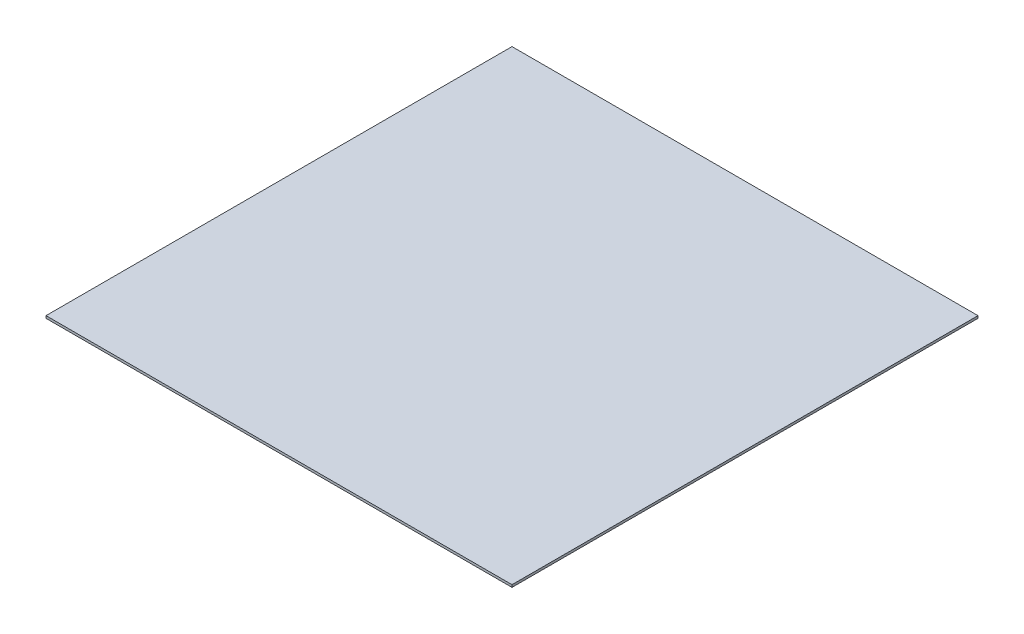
ISO-10303-21;
HEADER;
FILE_DESCRIPTION(('STEP AP214'),'2;1');
FILE_NAME('part.step','',(''),(''),'','','');
FILE_SCHEMA(('AUTOMOTIVE_DESIGN { 1 0 10303 214 1 1 1 1 }'));
ENDSEC;
DATA;
#1=APPLICATION_CONTEXT('core data for automotive mechanical design processes');
#2=APPLICATION_PROTOCOL_DEFINITION('international standard','automotive_design',2000,#1);
#3=PRODUCT_CONTEXT('',#1,'mechanical');
#4=PRODUCT('Part','Part','',(#3));
#5=PRODUCT_RELATED_PRODUCT_CATEGORY('part','',(#4));
#6=PRODUCT_DEFINITION_FORMATION('','',#4);
#7=PRODUCT_DEFINITION_CONTEXT('part definition',#1,'design');
#8=PRODUCT_DEFINITION('design','',#6,#7);
#9=PRODUCT_DEFINITION_SHAPE('','',#8);
#10=(LENGTH_UNIT() NAMED_UNIT(*) SI_UNIT(.MILLI.,.METRE.));
#11=(NAMED_UNIT(*) PLANE_ANGLE_UNIT() SI_UNIT($,.RADIAN.));
#12=(NAMED_UNIT(*) SI_UNIT($,.STERADIAN.) SOLID_ANGLE_UNIT());
#13=UNCERTAINTY_MEASURE_WITH_UNIT(LENGTH_MEASURE(1.E-05),#10,'distance_accuracy_value','');
#14=(GEOMETRIC_REPRESENTATION_CONTEXT(3) GLOBAL_UNCERTAINTY_ASSIGNED_CONTEXT((#13)) GLOBAL_UNIT_ASSIGNED_CONTEXT((#10,
#11,#12)) REPRESENTATION_CONTEXT('',''));
#15=CARTESIAN_POINT('',(0.,0.,0.));
#16=DIRECTION('',(0.,0.,1.));
#17=DIRECTION('',(1.,0.,0.));
#18=AXIS2_PLACEMENT_3D('',#15,#16,#17);
#19=CARTESIAN_POINT('',(2500.,12.7,-2500.));
#20=DIRECTION('',(0.,0.,1.));
#21=DIRECTION('',(1.,0.,0.));
#22=AXIS2_PLACEMENT_3D('',#19,#20,#21);
#23=PLANE('',#22);
#24=DIRECTION('',(0.,1.,0.));
#25=VECTOR('',#24,1.);
#26=CARTESIAN_POINT('',(-2500.,12.7,-2500.));
#27=LINE('',#26,#25);
#28=CARTESIAN_POINT('',(-2500.,-12.7,-2500.));
#29=VERTEX_POINT('',#28);
#30=CARTESIAN_POINT('',(-2500.,12.7,-2500.));
#31=VERTEX_POINT('',#30);
#32=EDGE_CURVE('E95',#29,#31,#27,.T.);
#33=ORIENTED_EDGE('',*,*,#32,.T.);
#34=DIRECTION('',(-1.,0.,0.));
#35=VECTOR('',#34,1.);
#36=CARTESIAN_POINT('',(2500.,12.7,-2500.));
#37=LINE('',#36,#35);
#38=CARTESIAN_POINT('',(2500.,12.7,-2500.));
#39=VERTEX_POINT('',#38);
#40=EDGE_CURVE('E11',#39,#31,#37,.T.);
#41=ORIENTED_EDGE('',*,*,#40,.F.);
#42=DIRECTION('',(0.,1.,0.));
#43=VECTOR('',#42,1.);
#44=CARTESIAN_POINT('',(2500.,12.7,-2500.));
#45=LINE('',#44,#43);
#46=CARTESIAN_POINT('',(2500.,-12.7,-2500.));
#47=VERTEX_POINT('',#46);
#48=EDGE_CURVE('E83',#47,#39,#45,.T.);
#49=ORIENTED_EDGE('',*,*,#48,.F.);
#50=DIRECTION('',(-1.,0.,0.));
#51=VECTOR('',#50,1.);
#52=CARTESIAN_POINT('',(2500.,-12.7,-2500.));
#53=LINE('',#52,#51);
#54=EDGE_CURVE('E91',#47,#29,#53,.T.);
#55=ORIENTED_EDGE('',*,*,#54,.T.);
#56=EDGE_LOOP('',(#33,#41,#49,#55));
#57=FACE_BOUND('',#56,.T.);
#58=ADVANCED_FACE('F32',(#57),#23,.F.);
#59=CARTESIAN_POINT('',(2500.,12.7,2500.));
#60=DIRECTION('',(0.,-1.,0.));
#61=DIRECTION('',(0.,0.,-1.));
#62=AXIS2_PLACEMENT_3D('',#59,#60,#61);
#63=PLANE('',#62);
#64=DIRECTION('',(0.,0.,1.));
#65=VECTOR('',#64,1.);
#66=CARTESIAN_POINT('',(-2500.,12.7,2500.));
#67=LINE('',#66,#65);
#68=CARTESIAN_POINT('',(-2500.,12.7,2500.));
#69=VERTEX_POINT('',#68);
#70=EDGE_CURVE('E87',#31,#69,#67,.T.);
#71=ORIENTED_EDGE('',*,*,#70,.T.);
#72=DIRECTION('',(-1.,0.,0.));
#73=VECTOR('',#72,1.);
#74=CARTESIAN_POINT('',(2500.,12.7,2500.));
#75=LINE('',#74,#73);
#76=CARTESIAN_POINT('',(2500.,12.7,2500.));
#77=VERTEX_POINT('',#76);
#78=EDGE_CURVE('E40',#77,#69,#75,.T.);
#79=ORIENTED_EDGE('',*,*,#78,.F.);
#80=DIRECTION('',(0.,0.,1.));
#81=VECTOR('',#80,1.);
#82=CARTESIAN_POINT('',(2500.,12.7,2500.));
#83=LINE('',#82,#81);
#84=EDGE_CURVE('E78',#39,#77,#83,.T.);
#85=ORIENTED_EDGE('',*,*,#84,.F.);
#86=ORIENTED_EDGE('',*,*,#40,.T.);
#87=EDGE_LOOP('',(#71,#79,#85,#86));
#88=FACE_BOUND('',#87,.T.);
#89=ADVANCED_FACE('F86',(#88),#63,.F.);
#90=CARTESIAN_POINT('',(2500.,12.7,2500.));
#91=DIRECTION('',(0.,0.,-1.));
#92=DIRECTION('',(-1.,0.,0.));
#93=AXIS2_PLACEMENT_3D('',#90,#91,#92);
#94=PLANE('',#93);
#95=DIRECTION('',(0.,-1.,0.));
#96=VECTOR('',#95,1.);
#97=CARTESIAN_POINT('',(-2500.,12.7,2500.));
#98=LINE('',#97,#96);
#99=CARTESIAN_POINT('',(-2500.,-12.7,2500.));
#100=VERTEX_POINT('',#99);
#101=EDGE_CURVE('E65',#69,#100,#98,.T.);
#102=ORIENTED_EDGE('',*,*,#101,.T.);
#103=DIRECTION('',(-1.,0.,0.));
#104=VECTOR('',#103,1.);
#105=CARTESIAN_POINT('',(2500.,-12.7,2500.));
#106=LINE('',#105,#104);
#107=CARTESIAN_POINT('',(2500.,-12.7,2500.));
#108=VERTEX_POINT('',#107);
#109=EDGE_CURVE('E88',#108,#100,#106,.T.);
#110=ORIENTED_EDGE('',*,*,#109,.F.);
#111=DIRECTION('',(0.,-1.,0.));
#112=VECTOR('',#111,1.);
#113=CARTESIAN_POINT('',(2500.,12.7,2500.));
#114=LINE('',#113,#112);
#115=EDGE_CURVE('E81',#77,#108,#114,.T.);
#116=ORIENTED_EDGE('',*,*,#115,.F.);
#117=ORIENTED_EDGE('',*,*,#78,.T.);
#118=EDGE_LOOP('',(#102,#110,#116,#117));
#119=FACE_BOUND('',#118,.T.);
#120=ADVANCED_FACE('F89',(#119),#94,.F.);
#121=CARTESIAN_POINT('',(2500.,-12.7,2500.));
#122=DIRECTION('',(0.,1.,0.));
#123=DIRECTION('',(0.,0.,1.));
#124=AXIS2_PLACEMENT_3D('',#121,#122,#123);
#125=PLANE('',#124);
#126=DIRECTION('',(0.,0.,-1.));
#127=VECTOR('',#126,1.);
#128=CARTESIAN_POINT('',(-2500.,-12.7,2500.));
#129=LINE('',#128,#127);
#130=EDGE_CURVE('E71',#100,#29,#129,.T.);
#131=ORIENTED_EDGE('',*,*,#130,.T.);
#132=ORIENTED_EDGE('',*,*,#54,.F.);
#133=DIRECTION('',(0.,0.,-1.));
#134=VECTOR('',#133,1.);
#135=CARTESIAN_POINT('',(2500.,-12.7,2500.));
#136=LINE('',#135,#134);
#137=EDGE_CURVE('E48',#108,#47,#136,.T.);
#138=ORIENTED_EDGE('',*,*,#137,.F.);
#139=ORIENTED_EDGE('',*,*,#109,.T.);
#140=EDGE_LOOP('',(#131,#132,#138,#139));
#141=FACE_BOUND('',#140,.T.);
#142=ADVANCED_FACE('F102',(#141),#125,.F.);
#143=CARTESIAN_POINT('',(2500.,0.,0.));
#144=DIRECTION('',(1.,0.,0.));
#145=DIRECTION('',(0.,0.,-1.));
#146=AXIS2_PLACEMENT_3D('',#143,#144,#145);
#147=PLANE('',#146);
#148=ORIENTED_EDGE('',*,*,#48,.T.);
#149=ORIENTED_EDGE('',*,*,#84,.T.);
#150=ORIENTED_EDGE('',*,*,#115,.T.);
#151=ORIENTED_EDGE('',*,*,#137,.T.);
#152=EDGE_LOOP('',(#148,#149,#150,#151));
#153=FACE_BOUND('',#152,.T.);
#154=ADVANCED_FACE('F79',(#153),#147,.T.);
#155=CARTESIAN_POINT('',(-2500.,0.,0.));
#156=DIRECTION('',(1.,0.,0.));
#157=DIRECTION('',(0.,0.,-1.));
#158=AXIS2_PLACEMENT_3D('',#155,#156,#157);
#159=PLANE('',#158);
#160=ORIENTED_EDGE('',*,*,#32,.F.);
#161=ORIENTED_EDGE('',*,*,#130,.F.);
#162=ORIENTED_EDGE('',*,*,#101,.F.);
#163=ORIENTED_EDGE('',*,*,#70,.F.);
#164=EDGE_LOOP('',(#160,#161,#162,#163));
#165=FACE_BOUND('',#164,.T.);
#166=ADVANCED_FACE('F105',(#165),#159,.F.);
#167=CLOSED_SHELL('',(#58,#89,#120,#142,#154,#166));
#168=MANIFOLD_SOLID_BREP('B2',#167);
#169=ADVANCED_BREP_SHAPE_REPRESENTATION('',(#18,#168),#14);
#170=SHAPE_DEFINITION_REPRESENTATION(#9,#169);
ENDSEC;
END-ISO-10303-21;
